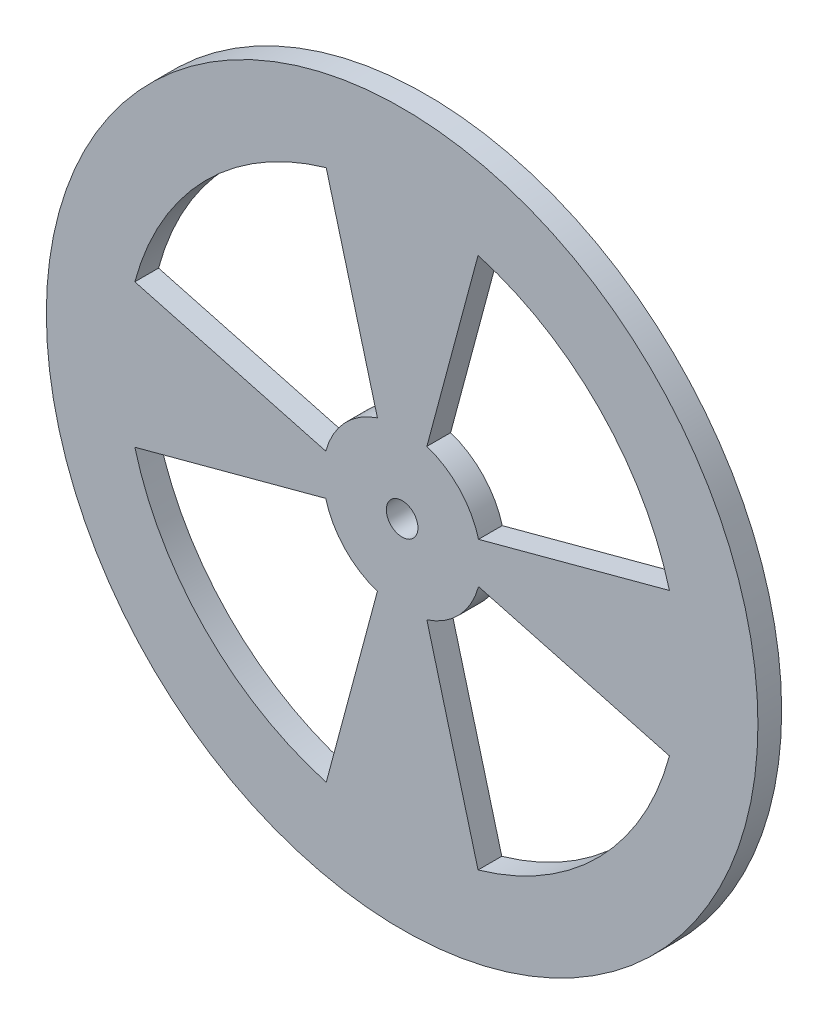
from build123d import *

# Parameters (mm, degrees)
ESQUISSE1_R        = 45
ESQUISSE1_R_2      = 35
ESQUISSE1_R_3      = 10
ESQUISSE1_R_4      = 2
BOSS_EXTRU_1_DEPTH = 3


with BuildPart() as part:
    # Esquisse1 → Boss.-Extru.1 (new body)
    # profile 1 of 6: a face of its own
    with BuildSketch(Plane.XY):
        Circle(ESQUISSE1_R)
        Circle(ESQUISSE1_R_2, mode=Mode.SUBTRACT)
    # profile 2 of 6: a face of its own
    with BuildSketch(Plane.XY):
        with BuildLine():
            Line((-3.127715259, -9.498283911), (-9.601122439, -33.657368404))
            ThreePointArc((-9.601122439, -33.657368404), (0, -35), (9.601122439, -33.657368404))
            Line((9.601122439, -33.657368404), (3.127715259, -9.498283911))
            ThreePointArc((3.127715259, -9.498283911), (0, -10), (-3.127715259, -9.498283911))
        make_face()
    # profile 3 of 6: a face of its own
    with BuildSketch(Plane.XY):
        with BuildLine():
            ThreePointArc((35, 0), (34.700570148, 4.568416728), (33.80740392, 9.058666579))
            Line((33.80740392, 9.058666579), (9.659258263, 2.588190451))
            ThreePointArc((9.659258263, 2.588190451), (9.914448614, 1.305261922), (10, 0))
            ThreePointArc((10, 0), (9.914448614, -1.305261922), (9.659258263, -2.588190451))
            Line((9.659258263, -2.588190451), (33.80740392, -9.058666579))
            ThreePointArc((33.80740392, -9.058666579), (34.700570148, -4.568416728), (35, 0))
        make_face()
    # profile 4 of 6: a face of its own
    with BuildSketch(Plane.XY):
        Circle(ESQUISSE1_R_3)
        Circle(ESQUISSE1_R_4, mode=Mode.SUBTRACT)
    # profile 5 of 6: a face of its own
    with BuildSketch(Plane.XY):
        with BuildLine():
            ThreePointArc((9.601122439, 33.657368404), (0, 35), (-9.601122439, 33.657368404))
            Line((-9.601122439, 33.657368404), (-3.127715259, 9.498283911))
            ThreePointArc((-3.127715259, 9.498283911), (0, 10), (3.127715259, 9.498283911))
            Line((3.127715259, 9.498283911), (9.601122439, 33.657368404))
        make_face()
    # profile 6 of 6: a face of its own
    with BuildSketch(Plane.XY):
        with BuildLine():
            Line((-9.659258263, 2.588190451), (-33.80740392, 9.058666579))
            ThreePointArc((-33.80740392, 9.058666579), (-35, 0), (-33.80740392, -9.058666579))
            Line((-33.80740392, -9.058666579), (-9.659258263, -2.588190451))
            ThreePointArc((-9.659258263, -2.588190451), (-10, 0), (-9.659258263, 2.588190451))
        make_face()
    extrude(amount=BOSS_EXTRU_1_DEPTH)


solid = part.part
